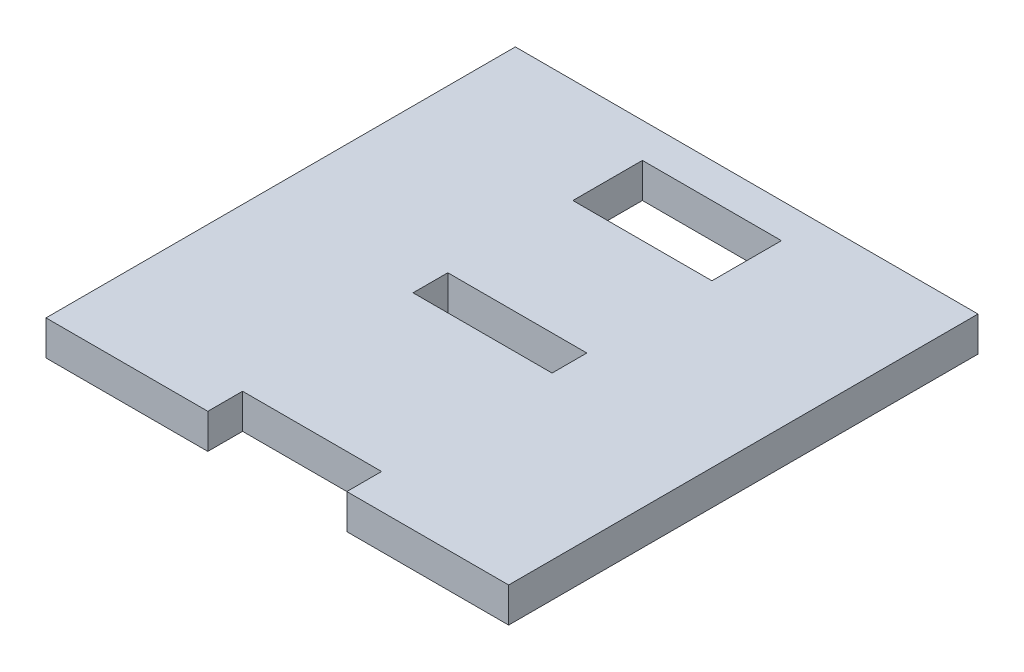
ISO-10303-21;
HEADER;
FILE_DESCRIPTION(('STEP AP214'),'2;1');
FILE_NAME('part.step','',(''),(''),'','','');
FILE_SCHEMA(('AUTOMOTIVE_DESIGN { 1 0 10303 214 1 1 1 1 }'));
ENDSEC;
DATA;
#1=APPLICATION_CONTEXT('core data for automotive mechanical design processes');
#2=APPLICATION_PROTOCOL_DEFINITION('international standard','automotive_design',2000,#1);
#3=PRODUCT_CONTEXT('',#1,'mechanical');
#4=PRODUCT('Part','Part','',(#3));
#5=PRODUCT_RELATED_PRODUCT_CATEGORY('part','',(#4));
#6=PRODUCT_DEFINITION_FORMATION('','',#4);
#7=PRODUCT_DEFINITION_CONTEXT('part definition',#1,'design');
#8=PRODUCT_DEFINITION('design','',#6,#7);
#9=PRODUCT_DEFINITION_SHAPE('','',#8);
#10=(LENGTH_UNIT() NAMED_UNIT(*) SI_UNIT(.MILLI.,.METRE.));
#11=(NAMED_UNIT(*) PLANE_ANGLE_UNIT() SI_UNIT($,.RADIAN.));
#12=(NAMED_UNIT(*) SI_UNIT($,.STERADIAN.) SOLID_ANGLE_UNIT());
#13=UNCERTAINTY_MEASURE_WITH_UNIT(LENGTH_MEASURE(1.E-05),#10,'distance_accuracy_value','');
#14=(GEOMETRIC_REPRESENTATION_CONTEXT(3) GLOBAL_UNCERTAINTY_ASSIGNED_CONTEXT((#13)) GLOBAL_UNIT_ASSIGNED_CONTEXT((#10,
#11,#12)) REPRESENTATION_CONTEXT('',''));
#15=CARTESIAN_POINT('',(0.,0.,0.));
#16=DIRECTION('',(0.,0.,1.));
#17=DIRECTION('',(1.,0.,0.));
#18=AXIS2_PLACEMENT_3D('',#15,#16,#17);
#19=CARTESIAN_POINT('',(0.,5.,0.));
#20=DIRECTION('',(0.,-1.,0.));
#21=DIRECTION('',(0.,0.,-1.));
#22=AXIS2_PLACEMENT_3D('',#19,#20,#21);
#23=PLANE('',#22);
#24=DIRECTION('',(0.,0.,1.));
#25=VECTOR('',#24,1.);
#26=CARTESIAN_POINT('',(23.28035,5.,-109.8613654));
#27=LINE('',#26,#25);
#28=CARTESIAN_POINT('',(23.28035,5.,-109.8613654));
#29=VERTEX_POINT('',#28);
#30=CARTESIAN_POINT('',(23.28035,5.,-99.8613654));
#31=VERTEX_POINT('',#30);
#32=EDGE_CURVE('E188',#29,#31,#27,.T.);
#33=ORIENTED_EDGE('',*,*,#32,.F.);
#34=DIRECTION('',(-1.,0.,0.));
#35=VECTOR('',#34,1.);
#36=CARTESIAN_POINT('',(23.28035,5.,-109.8613654));
#37=LINE('',#36,#35);
#38=CARTESIAN_POINT('',(43.28035,5.,-109.8613654));
#39=VERTEX_POINT('',#38);
#40=EDGE_CURVE('E196',#39,#29,#37,.T.);
#41=ORIENTED_EDGE('',*,*,#40,.F.);
#42=DIRECTION('',(0.,0.,-1.));
#43=VECTOR('',#42,1.);
#44=CARTESIAN_POINT('',(43.28035,5.,-109.8613654));
#45=LINE('',#44,#43);
#46=CARTESIAN_POINT('',(43.28035,5.,-99.8613654));
#47=VERTEX_POINT('',#46);
#48=EDGE_CURVE('E193',#47,#39,#45,.T.);
#49=ORIENTED_EDGE('',*,*,#48,.F.);
#50=DIRECTION('',(1.,0.,0.));
#51=VECTOR('',#50,1.);
#52=CARTESIAN_POINT('',(23.28035,5.,-99.8613654));
#53=LINE('',#52,#51);
#54=EDGE_CURVE('E190',#31,#47,#53,.T.);
#55=ORIENTED_EDGE('',*,*,#54,.F.);
#56=EDGE_LOOP('',(#33,#41,#49,#55));
#57=FACE_BOUND('',#56,.T.);
#58=DIRECTION('',(0.,0.,-1.));
#59=VECTOR('',#58,1.);
#60=CARTESIAN_POINT('',(66.5607,5.,-47.338));
#61=LINE('',#60,#59);
#62=CARTESIAN_POINT('',(66.5607,5.,-47.338));
#63=VERTEX_POINT('',#62);
#64=CARTESIAN_POINT('',(66.5607,5.,-114.8613654));
#65=VERTEX_POINT('',#64);
#66=EDGE_CURVE('E219',#63,#65,#61,.T.);
#67=ORIENTED_EDGE('',*,*,#66,.T.);
#68=DIRECTION('',(-1.,0.,0.));
#69=VECTOR('',#68,1.);
#70=CARTESIAN_POINT('',(0.,5.,-114.8613654));
#71=LINE('',#70,#69);
#72=CARTESIAN_POINT('',(0.,5.,-114.8613654));
#73=VERTEX_POINT('',#72);
#74=EDGE_CURVE('E222',#65,#73,#71,.T.);
#75=ORIENTED_EDGE('',*,*,#74,.T.);
#76=DIRECTION('',(0.,0.,1.));
#77=VECTOR('',#76,1.);
#78=CARTESIAN_POINT('',(0.,5.,-114.8613654));
#79=LINE('',#78,#77);
#80=CARTESIAN_POINT('',(0.,5.,-47.338));
#81=VERTEX_POINT('',#80);
#82=EDGE_CURVE('E225',#73,#81,#79,.T.);
#83=ORIENTED_EDGE('',*,*,#82,.T.);
#84=DIRECTION('',(1.,0.,0.));
#85=VECTOR('',#84,1.);
#86=CARTESIAN_POINT('',(0.,5.,-47.338));
#87=LINE('',#86,#85);
#88=CARTESIAN_POINT('',(23.28035,5.,-47.338));
#89=VERTEX_POINT('',#88);
#90=EDGE_CURVE('E227',#81,#89,#87,.T.);
#91=ORIENTED_EDGE('',*,*,#90,.T.);
#92=DIRECTION('',(0.,0.,-1.));
#93=VECTOR('',#92,1.);
#94=CARTESIAN_POINT('',(23.28035,5.,-47.338));
#95=LINE('',#94,#93);
#96=CARTESIAN_POINT('',(23.28035,5.,-52.338));
#97=VERTEX_POINT('',#96);
#98=EDGE_CURVE('E229',#89,#97,#95,.T.);
#99=ORIENTED_EDGE('',*,*,#98,.T.);
#100=DIRECTION('',(1.,0.,0.));
#101=VECTOR('',#100,1.);
#102=CARTESIAN_POINT('',(23.28035,5.,-52.338));
#103=LINE('',#102,#101);
#104=CARTESIAN_POINT('',(43.28035,5.,-52.338));
#105=VERTEX_POINT('',#104);
#106=EDGE_CURVE('E231',#97,#105,#103,.T.);
#107=ORIENTED_EDGE('',*,*,#106,.T.);
#108=DIRECTION('',(0.,0.,1.));
#109=VECTOR('',#108,1.);
#110=CARTESIAN_POINT('',(43.28035,5.,-47.338));
#111=LINE('',#110,#109);
#112=CARTESIAN_POINT('',(43.28035,5.,-47.338));
#113=VERTEX_POINT('',#112);
#114=EDGE_CURVE('E233',#105,#113,#111,.T.);
#115=ORIENTED_EDGE('',*,*,#114,.T.);
#116=DIRECTION('',(1.,0.,0.));
#117=VECTOR('',#116,1.);
#118=CARTESIAN_POINT('',(43.28035,5.,-47.338));
#119=LINE('',#118,#117);
#120=EDGE_CURVE('E235',#113,#63,#119,.T.);
#121=ORIENTED_EDGE('',*,*,#120,.T.);
#122=EDGE_LOOP('',(#67,#75,#83,#91,#99,#107,#115,#121));
#123=FACE_BOUND('',#122,.T.);
#124=DIRECTION('',(0.,0.,1.));
#125=VECTOR('',#124,1.);
#126=CARTESIAN_POINT('',(23.28035,5.,-76.86424));
#127=LINE('',#126,#125);
#128=CARTESIAN_POINT('',(23.28035,5.,-81.86424));
#129=VERTEX_POINT('',#128);
#130=CARTESIAN_POINT('',(23.28035,5.,-76.86424));
#131=VERTEX_POINT('',#130);
#132=EDGE_CURVE('E152',#129,#131,#127,.T.);
#133=ORIENTED_EDGE('',*,*,#132,.F.);
#134=DIRECTION('',(-1.,0.,0.));
#135=VECTOR('',#134,1.);
#136=CARTESIAN_POINT('',(23.28035,5.,-81.86424));
#137=LINE('',#136,#135);
#138=CARTESIAN_POINT('',(43.28035,5.,-81.86424));
#139=VERTEX_POINT('',#138);
#140=EDGE_CURVE('E174',#139,#129,#137,.T.);
#141=ORIENTED_EDGE('',*,*,#140,.F.);
#142=DIRECTION('',(0.,0.,-1.));
#143=VECTOR('',#142,1.);
#144=CARTESIAN_POINT('',(43.28035,5.,-76.86424));
#145=LINE('',#144,#143);
#146=CARTESIAN_POINT('',(43.28035,5.,-76.86424));
#147=VERTEX_POINT('',#146);
#148=EDGE_CURVE('E172',#147,#139,#145,.T.);
#149=ORIENTED_EDGE('',*,*,#148,.F.);
#150=DIRECTION('',(1.,0.,0.));
#151=VECTOR('',#150,1.);
#152=CARTESIAN_POINT('',(23.28035,5.,-76.86424));
#153=LINE('',#152,#151);
#154=EDGE_CURVE('E160',#131,#147,#153,.T.);
#155=ORIENTED_EDGE('',*,*,#154,.F.);
#156=EDGE_LOOP('',(#133,#141,#149,#155));
#157=FACE_BOUND('',#156,.T.);
#158=ADVANCED_FACE('F39',(#57,#123,#157),#23,.F.);
#159=CARTESIAN_POINT('',(0.,0.,0.));
#160=DIRECTION('',(0.,-1.,0.));
#161=DIRECTION('',(0.,0.,-1.));
#162=AXIS2_PLACEMENT_3D('',#159,#160,#161);
#163=PLANE('',#162);
#164=DIRECTION('',(0.,0.,-1.));
#165=VECTOR('',#164,1.);
#166=CARTESIAN_POINT('',(66.5607,0.,-47.338));
#167=LINE('',#166,#165);
#168=CARTESIAN_POINT('',(66.5607,0.,-47.338));
#169=VERTEX_POINT('',#168);
#170=CARTESIAN_POINT('',(66.5607,0.,-114.8613654));
#171=VERTEX_POINT('',#170);
#172=EDGE_CURVE('E218',#169,#171,#167,.T.);
#173=ORIENTED_EDGE('',*,*,#172,.F.);
#174=DIRECTION('',(1.,0.,0.));
#175=VECTOR('',#174,1.);
#176=CARTESIAN_POINT('',(43.28035,0.,-47.338));
#177=LINE('',#176,#175);
#178=CARTESIAN_POINT('',(43.28035,0.,-47.338));
#179=VERTEX_POINT('',#178);
#180=EDGE_CURVE('E223',#179,#169,#177,.T.);
#181=ORIENTED_EDGE('',*,*,#180,.F.);
#182=DIRECTION('',(0.,0.,1.));
#183=VECTOR('',#182,1.);
#184=CARTESIAN_POINT('',(43.28035,0.,-47.338));
#185=LINE('',#184,#183);
#186=CARTESIAN_POINT('',(43.28035,0.,-52.338));
#187=VERTEX_POINT('',#186);
#188=EDGE_CURVE('E250',#187,#179,#185,.T.);
#189=ORIENTED_EDGE('',*,*,#188,.F.);
#190=DIRECTION('',(1.,0.,0.));
#191=VECTOR('',#190,1.);
#192=CARTESIAN_POINT('',(23.28035,0.,-52.338));
#193=LINE('',#192,#191);
#194=CARTESIAN_POINT('',(23.28035,0.,-52.338));
#195=VERTEX_POINT('',#194);
#196=EDGE_CURVE('E248',#195,#187,#193,.T.);
#197=ORIENTED_EDGE('',*,*,#196,.F.);
#198=DIRECTION('',(0.,0.,-1.));
#199=VECTOR('',#198,1.);
#200=CARTESIAN_POINT('',(23.28035,0.,-47.338));
#201=LINE('',#200,#199);
#202=CARTESIAN_POINT('',(23.28035,0.,-47.338));
#203=VERTEX_POINT('',#202);
#204=EDGE_CURVE('E246',#203,#195,#201,.T.);
#205=ORIENTED_EDGE('',*,*,#204,.F.);
#206=DIRECTION('',(1.,0.,0.));
#207=VECTOR('',#206,1.);
#208=CARTESIAN_POINT('',(0.,0.,-47.338));
#209=LINE('',#208,#207);
#210=CARTESIAN_POINT('',(0.,0.,-47.338));
#211=VERTEX_POINT('',#210);
#212=EDGE_CURVE('E244',#211,#203,#209,.T.);
#213=ORIENTED_EDGE('',*,*,#212,.F.);
#214=DIRECTION('',(0.,0.,1.));
#215=VECTOR('',#214,1.);
#216=CARTESIAN_POINT('',(0.,0.,-114.8613654));
#217=LINE('',#216,#215);
#218=CARTESIAN_POINT('',(0.,0.,-114.8613654));
#219=VERTEX_POINT('',#218);
#220=EDGE_CURVE('E242',#219,#211,#217,.T.);
#221=ORIENTED_EDGE('',*,*,#220,.F.);
#222=DIRECTION('',(-1.,0.,0.));
#223=VECTOR('',#222,1.);
#224=CARTESIAN_POINT('',(0.,0.,-114.8613654));
#225=LINE('',#224,#223);
#226=EDGE_CURVE('E240',#171,#219,#225,.T.);
#227=ORIENTED_EDGE('',*,*,#226,.F.);
#228=EDGE_LOOP('',(#173,#181,#189,#197,#205,#213,#221,#227));
#229=FACE_BOUND('',#228,.T.);
#230=DIRECTION('',(-1.,0.,0.));
#231=VECTOR('',#230,1.);
#232=CARTESIAN_POINT('',(23.28035,0.,-109.8613654));
#233=LINE('',#232,#231);
#234=CARTESIAN_POINT('',(43.28035,0.,-109.8613654));
#235=VERTEX_POINT('',#234);
#236=CARTESIAN_POINT('',(23.28035,0.,-109.8613654));
#237=VERTEX_POINT('',#236);
#238=EDGE_CURVE('E191',#235,#237,#233,.T.);
#239=ORIENTED_EDGE('',*,*,#238,.T.);
#240=DIRECTION('',(0.,0.,1.));
#241=VECTOR('',#240,1.);
#242=CARTESIAN_POINT('',(23.28035,0.,-109.8613654));
#243=LINE('',#242,#241);
#244=CARTESIAN_POINT('',(23.28035,0.,-99.8613654));
#245=VERTEX_POINT('',#244);
#246=EDGE_CURVE('E168',#237,#245,#243,.T.);
#247=ORIENTED_EDGE('',*,*,#246,.T.);
#248=DIRECTION('',(1.,0.,0.));
#249=VECTOR('',#248,1.);
#250=CARTESIAN_POINT('',(23.28035,0.,-99.8613654));
#251=LINE('',#250,#249);
#252=CARTESIAN_POINT('',(43.28035,0.,-99.8613654));
#253=VERTEX_POINT('',#252);
#254=EDGE_CURVE('E201',#245,#253,#251,.T.);
#255=ORIENTED_EDGE('',*,*,#254,.T.);
#256=DIRECTION('',(0.,0.,-1.));
#257=VECTOR('',#256,1.);
#258=CARTESIAN_POINT('',(43.28035,0.,-109.8613654));
#259=LINE('',#258,#257);
#260=EDGE_CURVE('E204',#253,#235,#259,.T.);
#261=ORIENTED_EDGE('',*,*,#260,.T.);
#262=EDGE_LOOP('',(#239,#247,#255,#261));
#263=FACE_BOUND('',#262,.T.);
#264=DIRECTION('',(-1.,0.,0.));
#265=VECTOR('',#264,1.);
#266=CARTESIAN_POINT('',(23.28035,0.,-81.86424));
#267=LINE('',#266,#265);
#268=CARTESIAN_POINT('',(43.28035,0.,-81.86424));
#269=VERTEX_POINT('',#268);
#270=CARTESIAN_POINT('',(23.28035,0.,-81.86424));
#271=VERTEX_POINT('',#270);
#272=EDGE_CURVE('E161',#269,#271,#267,.T.);
#273=ORIENTED_EDGE('',*,*,#272,.T.);
#274=DIRECTION('',(0.,0.,1.));
#275=VECTOR('',#274,1.);
#276=CARTESIAN_POINT('',(23.28035,0.,-76.86424));
#277=LINE('',#276,#275);
#278=CARTESIAN_POINT('',(23.28035,0.,-76.86424));
#279=VERTEX_POINT('',#278);
#280=EDGE_CURVE('E62',#271,#279,#277,.T.);
#281=ORIENTED_EDGE('',*,*,#280,.T.);
#282=DIRECTION('',(1.,0.,0.));
#283=VECTOR('',#282,1.);
#284=CARTESIAN_POINT('',(23.28035,0.,-76.86424));
#285=LINE('',#284,#283);
#286=CARTESIAN_POINT('',(43.28035,0.,-76.86424));
#287=VERTEX_POINT('',#286);
#288=EDGE_CURVE('E167',#279,#287,#285,.T.);
#289=ORIENTED_EDGE('',*,*,#288,.T.);
#290=DIRECTION('',(0.,0.,-1.));
#291=VECTOR('',#290,1.);
#292=CARTESIAN_POINT('',(43.28035,0.,-76.86424));
#293=LINE('',#292,#291);
#294=EDGE_CURVE('E180',#287,#269,#293,.T.);
#295=ORIENTED_EDGE('',*,*,#294,.T.);
#296=EDGE_LOOP('',(#273,#281,#289,#295));
#297=FACE_BOUND('',#296,.T.);
#298=ADVANCED_FACE('F280',(#229,#263,#297),#163,.T.);
#299=CARTESIAN_POINT('',(66.5607,5.,-47.338));
#300=DIRECTION('',(-1.,0.,0.));
#301=DIRECTION('',(0.,0.,1.));
#302=AXIS2_PLACEMENT_3D('',#299,#300,#301);
#303=PLANE('',#302);
#304=ORIENTED_EDGE('',*,*,#172,.T.);
#305=DIRECTION('',(0.,-1.,0.));
#306=VECTOR('',#305,1.);
#307=CARTESIAN_POINT('',(66.5607,5.,-114.8613654));
#308=LINE('',#307,#306);
#309=EDGE_CURVE('E11',#65,#171,#308,.T.);
#310=ORIENTED_EDGE('',*,*,#309,.F.);
#311=ORIENTED_EDGE('',*,*,#66,.F.);
#312=DIRECTION('',(0.,-1.,0.));
#313=VECTOR('',#312,1.);
#314=CARTESIAN_POINT('',(66.5607,5.,-47.338));
#315=LINE('',#314,#313);
#316=EDGE_CURVE('E237',#63,#169,#315,.T.);
#317=ORIENTED_EDGE('',*,*,#316,.T.);
#318=EDGE_LOOP('',(#304,#310,#311,#317));
#319=FACE_BOUND('',#318,.T.);
#320=ADVANCED_FACE('F41',(#319),#303,.F.);
#321=CARTESIAN_POINT('',(0.,5.,-114.8613654));
#322=DIRECTION('',(0.,0.,1.));
#323=DIRECTION('',(1.,0.,0.));
#324=AXIS2_PLACEMENT_3D('',#321,#322,#323);
#325=PLANE('',#324);
#326=ORIENTED_EDGE('',*,*,#226,.T.);
#327=DIRECTION('',(0.,-1.,0.));
#328=VECTOR('',#327,1.);
#329=CARTESIAN_POINT('',(0.,5.,-114.8613654));
#330=LINE('',#329,#328);
#331=EDGE_CURVE('E47',#73,#219,#330,.T.);
#332=ORIENTED_EDGE('',*,*,#331,.F.);
#333=ORIENTED_EDGE('',*,*,#74,.F.);
#334=ORIENTED_EDGE('',*,*,#309,.T.);
#335=EDGE_LOOP('',(#326,#332,#333,#334));
#336=FACE_BOUND('',#335,.T.);
#337=ADVANCED_FACE('F297',(#336),#325,.F.);
#338=CARTESIAN_POINT('',(0.,5.,-114.8613654));
#339=DIRECTION('',(1.,0.,0.));
#340=DIRECTION('',(0.,0.,-1.));
#341=AXIS2_PLACEMENT_3D('',#338,#339,#340);
#342=PLANE('',#341);
#343=ORIENTED_EDGE('',*,*,#220,.T.);
#344=DIRECTION('',(0.,-1.,0.));
#345=VECTOR('',#344,1.);
#346=CARTESIAN_POINT('',(0.,5.,-47.338));
#347=LINE('',#346,#345);
#348=EDGE_CURVE('E267',#81,#211,#347,.T.);
#349=ORIENTED_EDGE('',*,*,#348,.F.);
#350=ORIENTED_EDGE('',*,*,#82,.F.);
#351=ORIENTED_EDGE('',*,*,#331,.T.);
#352=EDGE_LOOP('',(#343,#349,#350,#351));
#353=FACE_BOUND('',#352,.T.);
#354=ADVANCED_FACE('F274',(#353),#342,.F.);
#355=CARTESIAN_POINT('',(0.,5.,-47.338));
#356=DIRECTION('',(0.,0.,-1.));
#357=DIRECTION('',(-1.,0.,0.));
#358=AXIS2_PLACEMENT_3D('',#355,#356,#357);
#359=PLANE('',#358);
#360=ORIENTED_EDGE('',*,*,#212,.T.);
#361=DIRECTION('',(0.,-1.,0.));
#362=VECTOR('',#361,1.);
#363=CARTESIAN_POINT('',(23.28035,5.,-47.338));
#364=LINE('',#363,#362);
#365=EDGE_CURVE('E264',#89,#203,#364,.T.);
#366=ORIENTED_EDGE('',*,*,#365,.F.);
#367=ORIENTED_EDGE('',*,*,#90,.F.);
#368=ORIENTED_EDGE('',*,*,#348,.T.);
#369=EDGE_LOOP('',(#360,#366,#367,#368));
#370=FACE_BOUND('',#369,.T.);
#371=ADVANCED_FACE('F286',(#370),#359,.F.);
#372=CARTESIAN_POINT('',(23.28035,5.,-47.338));
#373=DIRECTION('',(-1.,0.,0.));
#374=DIRECTION('',(0.,0.,1.));
#375=AXIS2_PLACEMENT_3D('',#372,#373,#374);
#376=PLANE('',#375);
#377=ORIENTED_EDGE('',*,*,#204,.T.);
#378=DIRECTION('',(0.,-1.,0.));
#379=VECTOR('',#378,1.);
#380=CARTESIAN_POINT('',(23.28035,5.,-52.338));
#381=LINE('',#380,#379);
#382=EDGE_CURVE('E261',#97,#195,#381,.T.);
#383=ORIENTED_EDGE('',*,*,#382,.F.);
#384=ORIENTED_EDGE('',*,*,#98,.F.);
#385=ORIENTED_EDGE('',*,*,#365,.T.);
#386=EDGE_LOOP('',(#377,#383,#384,#385));
#387=FACE_BOUND('',#386,.T.);
#388=ADVANCED_FACE('F290',(#387),#376,.F.);
#389=CARTESIAN_POINT('',(23.28035,5.,-52.338));
#390=DIRECTION('',(0.,0.,-1.));
#391=DIRECTION('',(-1.,0.,0.));
#392=AXIS2_PLACEMENT_3D('',#389,#390,#391);
#393=PLANE('',#392);
#394=ORIENTED_EDGE('',*,*,#196,.T.);
#395=DIRECTION('',(0.,-1.,0.));
#396=VECTOR('',#395,1.);
#397=CARTESIAN_POINT('',(43.28035,5.,-52.338));
#398=LINE('',#397,#396);
#399=EDGE_CURVE('E258',#105,#187,#398,.T.);
#400=ORIENTED_EDGE('',*,*,#399,.F.);
#401=ORIENTED_EDGE('',*,*,#106,.F.);
#402=ORIENTED_EDGE('',*,*,#382,.T.);
#403=EDGE_LOOP('',(#394,#400,#401,#402));
#404=FACE_BOUND('',#403,.T.);
#405=ADVANCED_FACE('F310',(#404),#393,.F.);
#406=CARTESIAN_POINT('',(43.28035,5.,-47.338));
#407=DIRECTION('',(1.,0.,0.));
#408=DIRECTION('',(0.,0.,-1.));
#409=AXIS2_PLACEMENT_3D('',#406,#407,#408);
#410=PLANE('',#409);
#411=ORIENTED_EDGE('',*,*,#188,.T.);
#412=DIRECTION('',(0.,-1.,0.));
#413=VECTOR('',#412,1.);
#414=CARTESIAN_POINT('',(43.28035,5.,-47.338));
#415=LINE('',#414,#413);
#416=EDGE_CURVE('E255',#113,#179,#415,.T.);
#417=ORIENTED_EDGE('',*,*,#416,.F.);
#418=ORIENTED_EDGE('',*,*,#114,.F.);
#419=ORIENTED_EDGE('',*,*,#399,.T.);
#420=EDGE_LOOP('',(#411,#417,#418,#419));
#421=FACE_BOUND('',#420,.T.);
#422=ADVANCED_FACE('F308',(#421),#410,.F.);
#423=CARTESIAN_POINT('',(43.28035,5.,-47.338));
#424=DIRECTION('',(0.,0.,-1.));
#425=DIRECTION('',(-1.,0.,0.));
#426=AXIS2_PLACEMENT_3D('',#423,#424,#425);
#427=PLANE('',#426);
#428=ORIENTED_EDGE('',*,*,#180,.T.);
#429=ORIENTED_EDGE('',*,*,#316,.F.);
#430=ORIENTED_EDGE('',*,*,#120,.F.);
#431=ORIENTED_EDGE('',*,*,#416,.T.);
#432=EDGE_LOOP('',(#428,#429,#430,#431));
#433=FACE_BOUND('',#432,.T.);
#434=ADVANCED_FACE('F303',(#433),#427,.F.);
#435=CARTESIAN_POINT('',(23.28035,5.,-109.8613654));
#436=DIRECTION('',(1.,0.,0.));
#437=DIRECTION('',(0.,0.,-1.));
#438=AXIS2_PLACEMENT_3D('',#435,#436,#437);
#439=PLANE('',#438);
#440=ORIENTED_EDGE('',*,*,#246,.F.);
#441=DIRECTION('',(0.,-1.,0.));
#442=VECTOR('',#441,1.);
#443=CARTESIAN_POINT('',(23.28035,5.,-109.8613654));
#444=LINE('',#443,#442);
#445=EDGE_CURVE('E198',#29,#237,#444,.T.);
#446=ORIENTED_EDGE('',*,*,#445,.F.);
#447=ORIENTED_EDGE('',*,*,#32,.T.);
#448=DIRECTION('',(0.,-1.,0.));
#449=VECTOR('',#448,1.);
#450=CARTESIAN_POINT('',(23.28035,5.,-99.8613654));
#451=LINE('',#450,#449);
#452=EDGE_CURVE('E215',#31,#245,#451,.T.);
#453=ORIENTED_EDGE('',*,*,#452,.T.);
#454=EDGE_LOOP('',(#440,#446,#447,#453));
#455=FACE_BOUND('',#454,.T.);
#456=ADVANCED_FACE('F328',(#455),#439,.T.);
#457=CARTESIAN_POINT('',(23.28035,5.,-99.8613654));
#458=DIRECTION('',(0.,0.,-1.));
#459=DIRECTION('',(-1.,0.,0.));
#460=AXIS2_PLACEMENT_3D('',#457,#458,#459);
#461=PLANE('',#460);
#462=ORIENTED_EDGE('',*,*,#254,.F.);
#463=ORIENTED_EDGE('',*,*,#452,.F.);
#464=ORIENTED_EDGE('',*,*,#54,.T.);
#465=DIRECTION('',(0.,-1.,0.));
#466=VECTOR('',#465,1.);
#467=CARTESIAN_POINT('',(43.28035,5.,-99.8613654));
#468=LINE('',#467,#466);
#469=EDGE_CURVE('E213',#47,#253,#468,.T.);
#470=ORIENTED_EDGE('',*,*,#469,.T.);
#471=EDGE_LOOP('',(#462,#463,#464,#470));
#472=FACE_BOUND('',#471,.T.);
#473=ADVANCED_FACE('F335',(#472),#461,.T.);
#474=CARTESIAN_POINT('',(43.28035,5.,-109.8613654));
#475=DIRECTION('',(-1.,0.,0.));
#476=DIRECTION('',(0.,0.,1.));
#477=AXIS2_PLACEMENT_3D('',#474,#475,#476);
#478=PLANE('',#477);
#479=ORIENTED_EDGE('',*,*,#260,.F.);
#480=ORIENTED_EDGE('',*,*,#469,.F.);
#481=ORIENTED_EDGE('',*,*,#48,.T.);
#482=DIRECTION('',(0.,-1.,0.));
#483=VECTOR('',#482,1.);
#484=CARTESIAN_POINT('',(43.28035,5.,-109.8613654));
#485=LINE('',#484,#483);
#486=EDGE_CURVE('E211',#39,#235,#485,.T.);
#487=ORIENTED_EDGE('',*,*,#486,.T.);
#488=EDGE_LOOP('',(#479,#480,#481,#487));
#489=FACE_BOUND('',#488,.T.);
#490=ADVANCED_FACE('F340',(#489),#478,.T.);
#491=CARTESIAN_POINT('',(23.28035,5.,-109.8613654));
#492=DIRECTION('',(0.,0.,1.));
#493=DIRECTION('',(1.,0.,0.));
#494=AXIS2_PLACEMENT_3D('',#491,#492,#493);
#495=PLANE('',#494);
#496=ORIENTED_EDGE('',*,*,#238,.F.);
#497=ORIENTED_EDGE('',*,*,#486,.F.);
#498=ORIENTED_EDGE('',*,*,#40,.T.);
#499=ORIENTED_EDGE('',*,*,#445,.T.);
#500=EDGE_LOOP('',(#496,#497,#498,#499));
#501=FACE_BOUND('',#500,.T.);
#502=ADVANCED_FACE('F346',(#501),#495,.T.);
#503=CARTESIAN_POINT('',(23.28035,5.,-76.86424));
#504=DIRECTION('',(1.,0.,0.));
#505=DIRECTION('',(0.,0.,-1.));
#506=AXIS2_PLACEMENT_3D('',#503,#504,#505);
#507=PLANE('',#506);
#508=ORIENTED_EDGE('',*,*,#280,.F.);
#509=DIRECTION('',(0.,-1.,0.));
#510=VECTOR('',#509,1.);
#511=CARTESIAN_POINT('',(23.28035,5.,-81.86424));
#512=LINE('',#511,#510);
#513=EDGE_CURVE('E156',#129,#271,#512,.T.);
#514=ORIENTED_EDGE('',*,*,#513,.F.);
#515=ORIENTED_EDGE('',*,*,#132,.T.);
#516=DIRECTION('',(0.,-1.,0.));
#517=VECTOR('',#516,1.);
#518=CARTESIAN_POINT('',(23.28035,5.,-76.86424));
#519=LINE('',#518,#517);
#520=EDGE_CURVE('E155',#131,#279,#519,.T.);
#521=ORIENTED_EDGE('',*,*,#520,.T.);
#522=EDGE_LOOP('',(#508,#514,#515,#521));
#523=FACE_BOUND('',#522,.T.);
#524=ADVANCED_FACE('F154',(#523),#507,.T.);
#525=CARTESIAN_POINT('',(23.28035,5.,-76.86424));
#526=DIRECTION('',(0.,0.,-1.));
#527=DIRECTION('',(-1.,0.,0.));
#528=AXIS2_PLACEMENT_3D('',#525,#526,#527);
#529=PLANE('',#528);
#530=ORIENTED_EDGE('',*,*,#288,.F.);
#531=ORIENTED_EDGE('',*,*,#520,.F.);
#532=ORIENTED_EDGE('',*,*,#154,.T.);
#533=DIRECTION('',(0.,-1.,0.));
#534=VECTOR('',#533,1.);
#535=CARTESIAN_POINT('',(43.28035,5.,-76.86424));
#536=LINE('',#535,#534);
#537=EDGE_CURVE('E169',#147,#287,#536,.T.);
#538=ORIENTED_EDGE('',*,*,#537,.T.);
#539=EDGE_LOOP('',(#530,#531,#532,#538));
#540=FACE_BOUND('',#539,.T.);
#541=ADVANCED_FACE('F164',(#540),#529,.T.);
#542=CARTESIAN_POINT('',(43.28035,5.,-76.86424));
#543=DIRECTION('',(-1.,0.,0.));
#544=DIRECTION('',(0.,0.,1.));
#545=AXIS2_PLACEMENT_3D('',#542,#543,#544);
#546=PLANE('',#545);
#547=ORIENTED_EDGE('',*,*,#294,.F.);
#548=ORIENTED_EDGE('',*,*,#537,.F.);
#549=ORIENTED_EDGE('',*,*,#148,.T.);
#550=DIRECTION('',(0.,-1.,0.));
#551=VECTOR('',#550,1.);
#552=CARTESIAN_POINT('',(43.28035,5.,-81.86424));
#553=LINE('',#552,#551);
#554=EDGE_CURVE('E54',#139,#269,#553,.T.);
#555=ORIENTED_EDGE('',*,*,#554,.T.);
#556=EDGE_LOOP('',(#547,#548,#549,#555));
#557=FACE_BOUND('',#556,.T.);
#558=ADVANCED_FACE('F365',(#557),#546,.T.);
#559=CARTESIAN_POINT('',(23.28035,5.,-81.86424));
#560=DIRECTION('',(0.,0.,1.));
#561=DIRECTION('',(1.,0.,0.));
#562=AXIS2_PLACEMENT_3D('',#559,#560,#561);
#563=PLANE('',#562);
#564=ORIENTED_EDGE('',*,*,#272,.F.);
#565=ORIENTED_EDGE('',*,*,#554,.F.);
#566=ORIENTED_EDGE('',*,*,#140,.T.);
#567=ORIENTED_EDGE('',*,*,#513,.T.);
#568=EDGE_LOOP('',(#564,#565,#566,#567));
#569=FACE_BOUND('',#568,.T.);
#570=ADVANCED_FACE('F368',(#569),#563,.T.);
#571=CLOSED_SHELL('',(#158,#298,#320,#337,#354,#371,#388,#405,#422,#434,#456,#473,#490,#502,
#524,#541,#558,#570));
#572=MANIFOLD_SOLID_BREP('B2',#571);
#573=ADVANCED_BREP_SHAPE_REPRESENTATION('',(#18,#572),#14);
#574=SHAPE_DEFINITION_REPRESENTATION(#9,#573);
ENDSEC;
END-ISO-10303-21;
